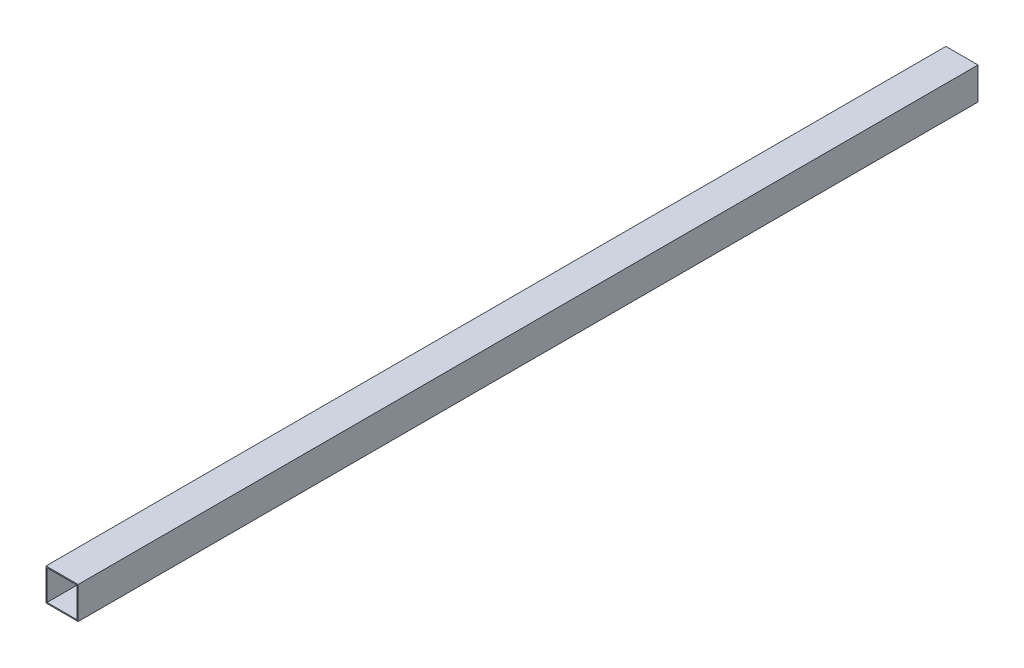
from build123d import *

# Parameters (mm, degrees)
SCHIZZO1_W                = 30
SCHIZZO1_H                = 30
SCHIZZO1_W_2              = 28
SCHIZZO1_H_2              = 28
ESTRUSIONE_SOTTILE1_DEPTH = 840


with BuildPart() as part:
    # Schizzo1 → Estrusione-Sottile1 (new body)
    with BuildSketch(Plane.XY):
        Rectangle(SCHIZZO1_W, SCHIZZO1_H)
        Rectangle(SCHIZZO1_W_2, SCHIZZO1_H_2, mode=Mode.SUBTRACT)
    extrude(amount=ESTRUSIONE_SOTTILE1_DEPTH)


solid = part.part
